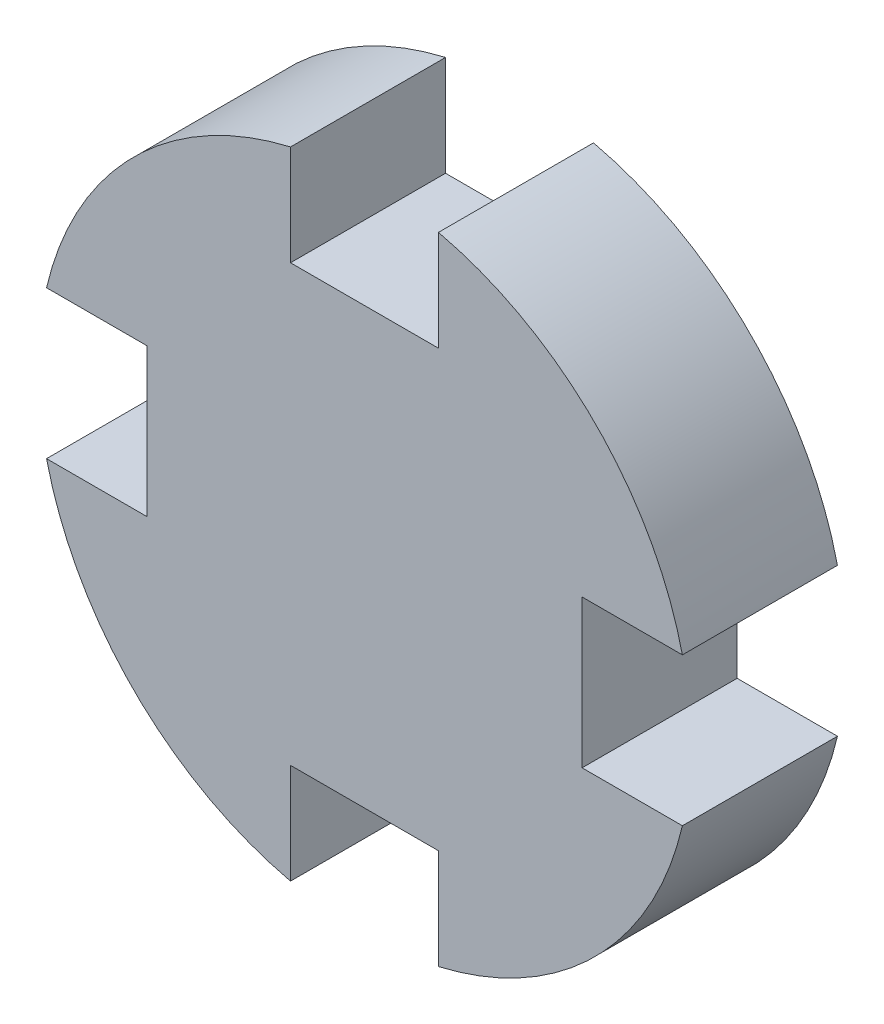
ISO-10303-21;
HEADER;
FILE_DESCRIPTION(('STEP AP214'),'2;1');
FILE_NAME('part.step','',(''),(''),'','','');
FILE_SCHEMA(('AUTOMOTIVE_DESIGN { 1 0 10303 214 1 1 1 1 }'));
ENDSEC;
DATA;
#1=APPLICATION_CONTEXT('core data for automotive mechanical design processes');
#2=APPLICATION_PROTOCOL_DEFINITION('international standard','automotive_design',2000,#1);
#3=PRODUCT_CONTEXT('',#1,'mechanical');
#4=PRODUCT('Part','Part','',(#3));
#5=PRODUCT_RELATED_PRODUCT_CATEGORY('part','',(#4));
#6=PRODUCT_DEFINITION_FORMATION('','',#4);
#7=PRODUCT_DEFINITION_CONTEXT('part definition',#1,'design');
#8=PRODUCT_DEFINITION('design','',#6,#7);
#9=PRODUCT_DEFINITION_SHAPE('','',#8);
#10=(LENGTH_UNIT() NAMED_UNIT(*) SI_UNIT(.MILLI.,.METRE.));
#11=(NAMED_UNIT(*) PLANE_ANGLE_UNIT() SI_UNIT($,.RADIAN.));
#12=(NAMED_UNIT(*) SI_UNIT($,.STERADIAN.) SOLID_ANGLE_UNIT());
#13=UNCERTAINTY_MEASURE_WITH_UNIT(LENGTH_MEASURE(1.E-05),#10,'distance_accuracy_value','');
#14=(GEOMETRIC_REPRESENTATION_CONTEXT(3) GLOBAL_UNCERTAINTY_ASSIGNED_CONTEXT((#13)) GLOBAL_UNIT_ASSIGNED_CONTEXT((#10,
#11,#12)) REPRESENTATION_CONTEXT('',''));
#15=CARTESIAN_POINT('',(0.,0.,0.));
#16=DIRECTION('',(0.,0.,1.));
#17=DIRECTION('',(1.,0.,0.));
#18=AXIS2_PLACEMENT_3D('',#15,#16,#17);
#19=CARTESIAN_POINT('',(0.,0.,5.7));
#20=DIRECTION('',(0.,0.,-1.));
#21=DIRECTION('',(-1.,0.,0.));
#22=AXIS2_PLACEMENT_3D('',#19,#20,#21);
#23=CYLINDRICAL_SURFACE('',#22,12.);
#24=CARTESIAN_POINT('',(0.,0.,5.7));
#25=DIRECTION('',(0.,0.,1.));
#26=DIRECTION('',(1.,0.,0.));
#27=AXIS2_PLACEMENT_3D('',#24,#25,#26);
#28=CIRCLE('',#27,12.);
#29=CARTESIAN_POINT('',(-11.6876687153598,-2.72,5.7));
#30=VERTEX_POINT('',#29);
#31=CARTESIAN_POINT('',(-2.72000000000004,-11.6876687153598,5.7));
#32=VERTEX_POINT('',#31);
#33=EDGE_CURVE('E237',#30,#32,#28,.T.);
#34=ORIENTED_EDGE('',*,*,#33,.F.);
#35=DIRECTION('',(0.,0.,-1.));
#36=VECTOR('',#35,1.);
#37=CARTESIAN_POINT('',(-11.6876687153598,-2.72,5.7));
#38=LINE('',#37,#36);
#39=CARTESIAN_POINT('',(-11.6876687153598,-2.72,0.));
#40=VERTEX_POINT('',#39);
#41=EDGE_CURVE('E191',#30,#40,#38,.T.);
#42=ORIENTED_EDGE('',*,*,#41,.T.);
#43=CARTESIAN_POINT('',(0.,0.,0.));
#44=DIRECTION('',(0.,0.,1.));
#45=DIRECTION('',(1.,0.,0.));
#46=AXIS2_PLACEMENT_3D('',#43,#44,#45);
#47=CIRCLE('',#46,12.);
#48=CARTESIAN_POINT('',(-2.72000000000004,-11.6876687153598,0.));
#49=VERTEX_POINT('',#48);
#50=EDGE_CURVE('E243',#40,#49,#47,.T.);
#51=ORIENTED_EDGE('',*,*,#50,.T.);
#52=DIRECTION('',(0.,0.,-1.));
#53=VECTOR('',#52,1.);
#54=CARTESIAN_POINT('',(-2.72000000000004,-11.6876687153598,5.7));
#55=LINE('',#54,#53);
#56=EDGE_CURVE('E206',#49,#32,#55,.F.);
#57=ORIENTED_EDGE('',*,*,#56,.T.);
#58=EDGE_LOOP('',(#34,#42,#51,#57));
#59=FACE_BOUND('',#58,.T.);
#60=ADVANCED_FACE('F35',(#59),#23,.T.);
#61=CARTESIAN_POINT('',(-2.71999999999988,11.6876687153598,0.));
#62=VERTEX_POINT('',#61);
#63=CARTESIAN_POINT('',(-11.6876687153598,2.72,0.));
#64=VERTEX_POINT('',#63);
#65=EDGE_CURVE('E242',#62,#64,#47,.T.);
#66=ORIENTED_EDGE('',*,*,#65,.T.);
#67=DIRECTION('',(0.,0.,-1.));
#68=VECTOR('',#67,1.);
#69=CARTESIAN_POINT('',(-11.6876687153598,2.72,5.7));
#70=LINE('',#69,#68);
#71=CARTESIAN_POINT('',(-11.6876687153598,2.72,5.7));
#72=VERTEX_POINT('',#71);
#73=EDGE_CURVE('E50',#64,#72,#70,.F.);
#74=ORIENTED_EDGE('',*,*,#73,.T.);
#75=CARTESIAN_POINT('',(-2.71999999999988,11.6876687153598,5.7));
#76=VERTEX_POINT('',#75);
#77=EDGE_CURVE('E170',#76,#72,#28,.T.);
#78=ORIENTED_EDGE('',*,*,#77,.F.);
#79=DIRECTION('',(0.,0.,-1.));
#80=VECTOR('',#79,1.);
#81=CARTESIAN_POINT('',(-2.71999999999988,11.6876687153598,5.7));
#82=LINE('',#81,#80);
#83=EDGE_CURVE('E187',#76,#62,#82,.T.);
#84=ORIENTED_EDGE('',*,*,#83,.T.);
#85=EDGE_LOOP('',(#66,#74,#78,#84));
#86=FACE_BOUND('',#85,.T.);
#87=ADVANCED_FACE('F293',(#86),#23,.T.);
#88=CARTESIAN_POINT('',(2.71999999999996,-11.6876687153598,5.7));
#89=VERTEX_POINT('',#88);
#90=CARTESIAN_POINT('',(11.6876687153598,-2.72,5.7));
#91=VERTEX_POINT('',#90);
#92=EDGE_CURVE('E238',#89,#91,#28,.T.);
#93=ORIENTED_EDGE('',*,*,#92,.F.);
#94=DIRECTION('',(0.,0.,-1.));
#95=VECTOR('',#94,1.);
#96=CARTESIAN_POINT('',(2.71999999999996,-11.6876687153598,5.7));
#97=LINE('',#96,#95);
#98=CARTESIAN_POINT('',(2.71999999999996,-11.6876687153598,0.));
#99=VERTEX_POINT('',#98);
#100=EDGE_CURVE('E210',#89,#99,#97,.T.);
#101=ORIENTED_EDGE('',*,*,#100,.T.);
#102=CARTESIAN_POINT('',(11.6876687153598,-2.72,0.));
#103=VERTEX_POINT('',#102);
#104=EDGE_CURVE('E232',#99,#103,#47,.T.);
#105=ORIENTED_EDGE('',*,*,#104,.T.);
#106=DIRECTION('',(0.,0.,-1.));
#107=VECTOR('',#106,1.);
#108=CARTESIAN_POINT('',(11.6876687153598,-2.72,5.7));
#109=LINE('',#108,#107);
#110=EDGE_CURVE('E225',#103,#91,#109,.F.);
#111=ORIENTED_EDGE('',*,*,#110,.T.);
#112=EDGE_LOOP('',(#93,#101,#105,#111));
#113=FACE_BOUND('',#112,.T.);
#114=ADVANCED_FACE('F290',(#113),#23,.T.);
#115=CARTESIAN_POINT('',(11.6876687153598,2.72,0.));
#116=VERTEX_POINT('',#115);
#117=CARTESIAN_POINT('',(2.72000000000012,11.6876687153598,0.));
#118=VERTEX_POINT('',#117);
#119=EDGE_CURVE('E239',#116,#118,#47,.T.);
#120=ORIENTED_EDGE('',*,*,#119,.T.);
#121=DIRECTION('',(0.,0.,-1.));
#122=VECTOR('',#121,1.);
#123=CARTESIAN_POINT('',(2.72000000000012,11.6876687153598,5.7));
#124=LINE('',#123,#122);
#125=CARTESIAN_POINT('',(2.72000000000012,11.6876687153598,5.7));
#126=VERTEX_POINT('',#125);
#127=EDGE_CURVE('E58',#118,#126,#124,.F.);
#128=ORIENTED_EDGE('',*,*,#127,.T.);
#129=CARTESIAN_POINT('',(11.6876687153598,2.72,5.7));
#130=VERTEX_POINT('',#129);
#131=EDGE_CURVE('E233',#130,#126,#28,.T.);
#132=ORIENTED_EDGE('',*,*,#131,.F.);
#133=DIRECTION('',(0.,0.,-1.));
#134=VECTOR('',#133,1.);
#135=CARTESIAN_POINT('',(11.6876687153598,2.72,5.7));
#136=LINE('',#135,#134);
#137=EDGE_CURVE('E229',#130,#116,#136,.T.);
#138=ORIENTED_EDGE('',*,*,#137,.T.);
#139=EDGE_LOOP('',(#120,#128,#132,#138));
#140=FACE_BOUND('',#139,.T.);
#141=ADVANCED_FACE('F37',(#140),#23,.T.);
#142=CARTESIAN_POINT('',(0.,0.,5.7));
#143=DIRECTION('',(0.,0.,1.));
#144=DIRECTION('',(1.,0.,0.));
#145=AXIS2_PLACEMENT_3D('',#142,#143,#144);
#146=PLANE('',#145);
#147=DIRECTION('',(1.,0.,0.));
#148=VECTOR('',#147,1.);
#149=CARTESIAN_POINT('',(-12.,-2.72,5.7));
#150=LINE('',#149,#148);
#151=CARTESIAN_POINT('',(-8.,-2.72,5.7));
#152=VERTEX_POINT('',#151);
#153=EDGE_CURVE('E155',#30,#152,#150,.T.);
#154=ORIENTED_EDGE('',*,*,#153,.F.);
#155=ORIENTED_EDGE('',*,*,#33,.T.);
#156=DIRECTION('',(0.,-1.,0.));
#157=VECTOR('',#156,1.);
#158=CARTESIAN_POINT('',(-2.72000000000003,-7.99999999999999,5.7));
#159=LINE('',#158,#157);
#160=CARTESIAN_POINT('',(-2.72000000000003,-7.99999999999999,5.7));
#161=VERTEX_POINT('',#160);
#162=EDGE_CURVE('E197',#161,#32,#159,.T.);
#163=ORIENTED_EDGE('',*,*,#162,.F.);
#164=DIRECTION('',(-1.,0.,0.));
#165=VECTOR('',#164,1.);
#166=CARTESIAN_POINT('',(2.71999999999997,-8.00000000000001,5.7));
#167=LINE('',#166,#165);
#168=CARTESIAN_POINT('',(2.71999999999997,-8.00000000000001,5.7));
#169=VERTEX_POINT('',#168);
#170=EDGE_CURVE('E194',#169,#161,#167,.T.);
#171=ORIENTED_EDGE('',*,*,#170,.F.);
#172=DIRECTION('',(0.,1.,0.));
#173=VECTOR('',#172,1.);
#174=CARTESIAN_POINT('',(2.71999999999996,-12.,5.7));
#175=LINE('',#174,#173);
#176=EDGE_CURVE('E200',#89,#169,#175,.T.);
#177=ORIENTED_EDGE('',*,*,#176,.F.);
#178=ORIENTED_EDGE('',*,*,#92,.T.);
#179=DIRECTION('',(1.,0.,0.));
#180=VECTOR('',#179,1.);
#181=CARTESIAN_POINT('',(8.,-2.72,5.7));
#182=LINE('',#181,#180);
#183=CARTESIAN_POINT('',(8.,-2.72,5.7));
#184=VERTEX_POINT('',#183);
#185=EDGE_CURVE('E216',#184,#91,#182,.T.);
#186=ORIENTED_EDGE('',*,*,#185,.F.);
#187=DIRECTION('',(0.,-1.,0.));
#188=VECTOR('',#187,1.);
#189=CARTESIAN_POINT('',(8.,2.72,5.7));
#190=LINE('',#189,#188);
#191=CARTESIAN_POINT('',(8.,2.72,5.7));
#192=VERTEX_POINT('',#191);
#193=EDGE_CURVE('E213',#192,#184,#190,.T.);
#194=ORIENTED_EDGE('',*,*,#193,.F.);
#195=DIRECTION('',(-1.,0.,0.));
#196=VECTOR('',#195,1.);
#197=CARTESIAN_POINT('',(12.,2.72,5.7));
#198=LINE('',#197,#196);
#199=EDGE_CURVE('E219',#130,#192,#198,.T.);
#200=ORIENTED_EDGE('',*,*,#199,.F.);
#201=ORIENTED_EDGE('',*,*,#131,.T.);
#202=DIRECTION('',(0.,1.,0.));
#203=VECTOR('',#202,1.);
#204=CARTESIAN_POINT('',(2.72000000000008,7.99999999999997,5.7));
#205=LINE('',#204,#203);
#206=CARTESIAN_POINT('',(2.72000000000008,7.99999999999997,5.7));
#207=VERTEX_POINT('',#206);
#208=EDGE_CURVE('E178',#207,#126,#205,.T.);
#209=ORIENTED_EDGE('',*,*,#208,.F.);
#210=DIRECTION('',(1.,0.,0.));
#211=VECTOR('',#210,1.);
#212=CARTESIAN_POINT('',(-2.71999999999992,8.00000000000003,5.7));
#213=LINE('',#212,#211);
#214=CARTESIAN_POINT('',(-2.71999999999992,8.00000000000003,5.7));
#215=VERTEX_POINT('',#214);
#216=EDGE_CURVE('E175',#215,#207,#213,.T.);
#217=ORIENTED_EDGE('',*,*,#216,.F.);
#218=DIRECTION('',(0.,-1.,0.));
#219=VECTOR('',#218,1.);
#220=CARTESIAN_POINT('',(-2.71999999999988,12.,5.7));
#221=LINE('',#220,#219);
#222=EDGE_CURVE('E180',#76,#215,#221,.T.);
#223=ORIENTED_EDGE('',*,*,#222,.F.);
#224=ORIENTED_EDGE('',*,*,#77,.T.);
#225=DIRECTION('',(-1.,0.,0.));
#226=VECTOR('',#225,1.);
#227=CARTESIAN_POINT('',(-8.,2.72,5.7));
#228=LINE('',#227,#226);
#229=CARTESIAN_POINT('',(-8.,2.72,5.7));
#230=VERTEX_POINT('',#229);
#231=EDGE_CURVE('E150',#230,#72,#228,.T.);
#232=ORIENTED_EDGE('',*,*,#231,.F.);
#233=DIRECTION('',(0.,1.,0.));
#234=VECTOR('',#233,1.);
#235=CARTESIAN_POINT('',(-8.,-2.72,5.7));
#236=LINE('',#235,#234);
#237=EDGE_CURVE('E158',#152,#230,#236,.T.);
#238=ORIENTED_EDGE('',*,*,#237,.F.);
#239=EDGE_LOOP('',(#154,#155,#163,#171,#177,#178,#186,#194,#200,#201,#209,#217,#223,#224,#232,#238));
#240=FACE_BOUND('',#239,.T.);
#241=ADVANCED_FACE('F167',(#240),#146,.T.);
#242=CARTESIAN_POINT('',(0.,0.,0.));
#243=DIRECTION('',(0.,0.,1.));
#244=DIRECTION('',(1.,0.,0.));
#245=AXIS2_PLACEMENT_3D('',#242,#243,#244);
#246=PLANE('',#245);
#247=ORIENTED_EDGE('',*,*,#50,.F.);
#248=DIRECTION('',(1.,0.,0.));
#249=VECTOR('',#248,1.);
#250=CARTESIAN_POINT('',(0.,-2.72,0.));
#251=LINE('',#250,#249);
#252=CARTESIAN_POINT('',(-8.,-2.72,0.));
#253=VERTEX_POINT('',#252);
#254=EDGE_CURVE('E11',#40,#253,#251,.T.);
#255=ORIENTED_EDGE('',*,*,#254,.T.);
#256=DIRECTION('',(0.,1.,0.));
#257=VECTOR('',#256,1.);
#258=CARTESIAN_POINT('',(-8.,0.,0.));
#259=LINE('',#258,#257);
#260=CARTESIAN_POINT('',(-8.,2.72,0.));
#261=VERTEX_POINT('',#260);
#262=EDGE_CURVE('E43',#253,#261,#259,.T.);
#263=ORIENTED_EDGE('',*,*,#262,.T.);
#264=DIRECTION('',(-1.,0.,0.));
#265=VECTOR('',#264,1.);
#266=CARTESIAN_POINT('',(0.,2.72,0.));
#267=LINE('',#266,#265);
#268=EDGE_CURVE('E151',#261,#64,#267,.T.);
#269=ORIENTED_EDGE('',*,*,#268,.T.);
#270=ORIENTED_EDGE('',*,*,#65,.F.);
#271=DIRECTION('',(0.,-1.,0.));
#272=VECTOR('',#271,1.);
#273=CARTESIAN_POINT('',(-2.72,0.,0.));
#274=LINE('',#273,#272);
#275=CARTESIAN_POINT('',(-2.71999999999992,8.00000000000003,0.));
#276=VERTEX_POINT('',#275);
#277=EDGE_CURVE('E266',#62,#276,#274,.T.);
#278=ORIENTED_EDGE('',*,*,#277,.T.);
#279=DIRECTION('',(1.,0.,0.));
#280=VECTOR('',#279,1.);
#281=CARTESIAN_POINT('',(0.,8.,0.));
#282=LINE('',#281,#280);
#283=CARTESIAN_POINT('',(2.72000000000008,7.99999999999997,0.));
#284=VERTEX_POINT('',#283);
#285=EDGE_CURVE('E263',#276,#284,#282,.T.);
#286=ORIENTED_EDGE('',*,*,#285,.T.);
#287=DIRECTION('',(0.,1.,0.));
#288=VECTOR('',#287,1.);
#289=CARTESIAN_POINT('',(2.72,0.,0.));
#290=LINE('',#289,#288);
#291=EDGE_CURVE('E261',#284,#118,#290,.T.);
#292=ORIENTED_EDGE('',*,*,#291,.T.);
#293=ORIENTED_EDGE('',*,*,#119,.F.);
#294=DIRECTION('',(-1.,0.,0.));
#295=VECTOR('',#294,1.);
#296=CARTESIAN_POINT('',(0.,2.72,0.));
#297=LINE('',#296,#295);
#298=CARTESIAN_POINT('',(8.,2.72,0.));
#299=VERTEX_POINT('',#298);
#300=EDGE_CURVE('E249',#116,#299,#297,.T.);
#301=ORIENTED_EDGE('',*,*,#300,.T.);
#302=DIRECTION('',(0.,-1.,0.));
#303=VECTOR('',#302,1.);
#304=CARTESIAN_POINT('',(8.,0.,0.));
#305=LINE('',#304,#303);
#306=CARTESIAN_POINT('',(8.,-2.72,0.));
#307=VERTEX_POINT('',#306);
#308=EDGE_CURVE('E246',#299,#307,#305,.T.);
#309=ORIENTED_EDGE('',*,*,#308,.T.);
#310=DIRECTION('',(1.,0.,0.));
#311=VECTOR('',#310,1.);
#312=CARTESIAN_POINT('',(0.,-2.72,0.));
#313=LINE('',#312,#311);
#314=EDGE_CURVE('E236',#307,#103,#313,.T.);
#315=ORIENTED_EDGE('',*,*,#314,.T.);
#316=ORIENTED_EDGE('',*,*,#104,.F.);
#317=DIRECTION('',(0.,1.,0.));
#318=VECTOR('',#317,1.);
#319=CARTESIAN_POINT('',(2.72,0.,0.));
#320=LINE('',#319,#318);
#321=CARTESIAN_POINT('',(2.71999999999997,-8.00000000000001,0.));
#322=VERTEX_POINT('',#321);
#323=EDGE_CURVE('E258',#99,#322,#320,.T.);
#324=ORIENTED_EDGE('',*,*,#323,.T.);
#325=DIRECTION('',(-1.,0.,0.));
#326=VECTOR('',#325,1.);
#327=CARTESIAN_POINT('',(0.,-8.,0.));
#328=LINE('',#327,#326);
#329=CARTESIAN_POINT('',(-2.72000000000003,-7.99999999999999,0.));
#330=VERTEX_POINT('',#329);
#331=EDGE_CURVE('E255',#322,#330,#328,.T.);
#332=ORIENTED_EDGE('',*,*,#331,.T.);
#333=DIRECTION('',(0.,-1.,0.));
#334=VECTOR('',#333,1.);
#335=CARTESIAN_POINT('',(-2.72,0.,0.));
#336=LINE('',#335,#334);
#337=EDGE_CURVE('E252',#330,#49,#336,.T.);
#338=ORIENTED_EDGE('',*,*,#337,.T.);
#339=EDGE_LOOP('',(#247,#255,#263,#269,#270,#278,#286,#292,#293,#301,#309,#315,#316,#324,#332,#338));
#340=FACE_BOUND('',#339,.T.);
#341=ADVANCED_FACE('F271',(#340),#246,.F.);
#342=CARTESIAN_POINT('',(8.,2.72,-4.3));
#343=DIRECTION('',(-1.,0.,0.));
#344=DIRECTION('',(0.,0.,1.));
#345=AXIS2_PLACEMENT_3D('',#342,#343,#344);
#346=PLANE('',#345);
#347=DIRECTION('',(0.,0.,1.));
#348=VECTOR('',#347,1.);
#349=CARTESIAN_POINT('',(8.,2.72,-4.3));
#350=LINE('',#349,#348);
#351=EDGE_CURVE('E223',#299,#192,#350,.T.);
#352=ORIENTED_EDGE('',*,*,#351,.T.);
#353=ORIENTED_EDGE('',*,*,#193,.T.);
#354=DIRECTION('',(0.,0.,1.));
#355=VECTOR('',#354,1.);
#356=CARTESIAN_POINT('',(8.,-2.72,-4.3));
#357=LINE('',#356,#355);
#358=EDGE_CURVE('E222',#307,#184,#357,.T.);
#359=ORIENTED_EDGE('',*,*,#358,.F.);
#360=ORIENTED_EDGE('',*,*,#308,.F.);
#361=EDGE_LOOP('',(#352,#353,#359,#360));
#362=FACE_BOUND('',#361,.T.);
#363=ADVANCED_FACE('F311',(#362),#346,.F.);
#364=CARTESIAN_POINT('',(12.,2.72,-4.3));
#365=DIRECTION('',(0.,1.,0.));
#366=DIRECTION('',(-1.,0.,0.));
#367=AXIS2_PLACEMENT_3D('',#364,#365,#366);
#368=PLANE('',#367);
#369=ORIENTED_EDGE('',*,*,#199,.T.);
#370=ORIENTED_EDGE('',*,*,#351,.F.);
#371=ORIENTED_EDGE('',*,*,#300,.F.);
#372=ORIENTED_EDGE('',*,*,#137,.F.);
#373=EDGE_LOOP('',(#369,#370,#371,#372));
#374=FACE_BOUND('',#373,.T.);
#375=ADVANCED_FACE('F308',(#374),#368,.F.);
#376=CARTESIAN_POINT('',(8.,-2.72,-4.3));
#377=DIRECTION('',(0.,-1.,0.));
#378=DIRECTION('',(1.,0.,0.));
#379=AXIS2_PLACEMENT_3D('',#376,#377,#378);
#380=PLANE('',#379);
#381=ORIENTED_EDGE('',*,*,#314,.F.);
#382=ORIENTED_EDGE('',*,*,#358,.T.);
#383=ORIENTED_EDGE('',*,*,#185,.T.);
#384=ORIENTED_EDGE('',*,*,#110,.F.);
#385=EDGE_LOOP('',(#381,#382,#383,#384));
#386=FACE_BOUND('',#385,.T.);
#387=ADVANCED_FACE('F288',(#386),#380,.F.);
#388=CARTESIAN_POINT('',(2.71999999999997,-8.00000000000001,-4.3));
#389=DIRECTION('',(0.,1.,0.));
#390=DIRECTION('',(-1.,0.,0.));
#391=AXIS2_PLACEMENT_3D('',#388,#389,#390);
#392=PLANE('',#391);
#393=DIRECTION('',(0.,0.,1.));
#394=VECTOR('',#393,1.);
#395=CARTESIAN_POINT('',(2.71999999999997,-8.00000000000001,-4.3));
#396=LINE('',#395,#394);
#397=EDGE_CURVE('E204',#322,#169,#396,.T.);
#398=ORIENTED_EDGE('',*,*,#397,.T.);
#399=ORIENTED_EDGE('',*,*,#170,.T.);
#400=DIRECTION('',(0.,0.,1.));
#401=VECTOR('',#400,1.);
#402=CARTESIAN_POINT('',(-2.72000000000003,-7.99999999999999,-4.3));
#403=LINE('',#402,#401);
#404=EDGE_CURVE('E203',#330,#161,#403,.T.);
#405=ORIENTED_EDGE('',*,*,#404,.F.);
#406=ORIENTED_EDGE('',*,*,#331,.F.);
#407=EDGE_LOOP('',(#398,#399,#405,#406));
#408=FACE_BOUND('',#407,.T.);
#409=ADVANCED_FACE('F350',(#408),#392,.F.);
#410=CARTESIAN_POINT('',(2.71999999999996,-12.,-4.3));
#411=DIRECTION('',(1.,0.,0.));
#412=DIRECTION('',(0.,1.,0.));
#413=AXIS2_PLACEMENT_3D('',#410,#411,#412);
#414=PLANE('',#413);
#415=ORIENTED_EDGE('',*,*,#176,.T.);
#416=ORIENTED_EDGE('',*,*,#397,.F.);
#417=ORIENTED_EDGE('',*,*,#323,.F.);
#418=ORIENTED_EDGE('',*,*,#100,.F.);
#419=EDGE_LOOP('',(#415,#416,#417,#418));
#420=FACE_BOUND('',#419,.T.);
#421=ADVANCED_FACE('F383',(#420),#414,.F.);
#422=CARTESIAN_POINT('',(-2.72000000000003,-7.99999999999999,-4.3));
#423=DIRECTION('',(-1.,0.,0.));
#424=DIRECTION('',(0.,-1.,0.));
#425=AXIS2_PLACEMENT_3D('',#422,#423,#424);
#426=PLANE('',#425);
#427=ORIENTED_EDGE('',*,*,#337,.F.);
#428=ORIENTED_EDGE('',*,*,#404,.T.);
#429=ORIENTED_EDGE('',*,*,#162,.T.);
#430=ORIENTED_EDGE('',*,*,#56,.F.);
#431=EDGE_LOOP('',(#427,#428,#429,#430));
#432=FACE_BOUND('',#431,.T.);
#433=ADVANCED_FACE('F393',(#432),#426,.F.);
#434=CARTESIAN_POINT('',(-2.71999999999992,8.00000000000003,-4.3));
#435=DIRECTION('',(0.,-1.,0.));
#436=DIRECTION('',(1.,0.,0.));
#437=AXIS2_PLACEMENT_3D('',#434,#435,#436);
#438=PLANE('',#437);
#439=DIRECTION('',(0.,0.,1.));
#440=VECTOR('',#439,1.);
#441=CARTESIAN_POINT('',(-2.71999999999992,8.00000000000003,-4.3));
#442=LINE('',#441,#440);
#443=EDGE_CURVE('E164',#276,#215,#442,.T.);
#444=ORIENTED_EDGE('',*,*,#443,.T.);
#445=ORIENTED_EDGE('',*,*,#216,.T.);
#446=DIRECTION('',(0.,0.,1.));
#447=VECTOR('',#446,1.);
#448=CARTESIAN_POINT('',(2.72000000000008,7.99999999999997,-4.3));
#449=LINE('',#448,#447);
#450=EDGE_CURVE('E183',#284,#207,#449,.T.);
#451=ORIENTED_EDGE('',*,*,#450,.F.);
#452=ORIENTED_EDGE('',*,*,#285,.F.);
#453=EDGE_LOOP('',(#444,#445,#451,#452));
#454=FACE_BOUND('',#453,.T.);
#455=ADVANCED_FACE('F299',(#454),#438,.F.);
#456=CARTESIAN_POINT('',(-2.71999999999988,12.,-4.3));
#457=DIRECTION('',(-1.,0.,0.));
#458=DIRECTION('',(0.,-1.,0.));
#459=AXIS2_PLACEMENT_3D('',#456,#457,#458);
#460=PLANE('',#459);
#461=ORIENTED_EDGE('',*,*,#222,.T.);
#462=ORIENTED_EDGE('',*,*,#443,.F.);
#463=ORIENTED_EDGE('',*,*,#277,.F.);
#464=ORIENTED_EDGE('',*,*,#83,.F.);
#465=EDGE_LOOP('',(#461,#462,#463,#464));
#466=FACE_BOUND('',#465,.T.);
#467=ADVANCED_FACE('F296',(#466),#460,.F.);
#468=CARTESIAN_POINT('',(2.72000000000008,7.99999999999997,-4.3));
#469=DIRECTION('',(1.,0.,0.));
#470=DIRECTION('',(0.,1.,0.));
#471=AXIS2_PLACEMENT_3D('',#468,#469,#470);
#472=PLANE('',#471);
#473=ORIENTED_EDGE('',*,*,#291,.F.);
#474=ORIENTED_EDGE('',*,*,#450,.T.);
#475=ORIENTED_EDGE('',*,*,#208,.T.);
#476=ORIENTED_EDGE('',*,*,#127,.F.);
#477=EDGE_LOOP('',(#473,#474,#475,#476));
#478=FACE_BOUND('',#477,.T.);
#479=ADVANCED_FACE('F302',(#478),#472,.F.);
#480=CARTESIAN_POINT('',(-8.,-2.72,-4.3));
#481=DIRECTION('',(1.,0.,0.));
#482=DIRECTION('',(0.,0.,-1.));
#483=AXIS2_PLACEMENT_3D('',#480,#481,#482);
#484=PLANE('',#483);
#485=DIRECTION('',(0.,0.,1.));
#486=VECTOR('',#485,1.);
#487=CARTESIAN_POINT('',(-8.,-2.72,-4.3));
#488=LINE('',#487,#486);
#489=EDGE_CURVE('E154',#253,#152,#488,.T.);
#490=ORIENTED_EDGE('',*,*,#489,.T.);
#491=ORIENTED_EDGE('',*,*,#237,.T.);
#492=DIRECTION('',(0.,0.,1.));
#493=VECTOR('',#492,1.);
#494=CARTESIAN_POINT('',(-8.,2.72,-4.3));
#495=LINE('',#494,#493);
#496=EDGE_CURVE('E146',#261,#230,#495,.T.);
#497=ORIENTED_EDGE('',*,*,#496,.F.);
#498=ORIENTED_EDGE('',*,*,#262,.F.);
#499=EDGE_LOOP('',(#490,#491,#497,#498));
#500=FACE_BOUND('',#499,.T.);
#501=ADVANCED_FACE('F159',(#500),#484,.F.);
#502=CARTESIAN_POINT('',(-12.,-2.72,-4.3));
#503=DIRECTION('',(0.,-1.,0.));
#504=DIRECTION('',(1.,0.,0.));
#505=AXIS2_PLACEMENT_3D('',#502,#503,#504);
#506=PLANE('',#505);
#507=ORIENTED_EDGE('',*,*,#153,.T.);
#508=ORIENTED_EDGE('',*,*,#489,.F.);
#509=ORIENTED_EDGE('',*,*,#254,.F.);
#510=ORIENTED_EDGE('',*,*,#41,.F.);
#511=EDGE_LOOP('',(#507,#508,#509,#510));
#512=FACE_BOUND('',#511,.T.);
#513=ADVANCED_FACE('F275',(#512),#506,.F.);
#514=CARTESIAN_POINT('',(-8.,2.72,-4.3));
#515=DIRECTION('',(0.,1.,0.));
#516=DIRECTION('',(-1.,0.,0.));
#517=AXIS2_PLACEMENT_3D('',#514,#515,#516);
#518=PLANE('',#517);
#519=ORIENTED_EDGE('',*,*,#268,.F.);
#520=ORIENTED_EDGE('',*,*,#496,.T.);
#521=ORIENTED_EDGE('',*,*,#231,.T.);
#522=ORIENTED_EDGE('',*,*,#73,.F.);
#523=EDGE_LOOP('',(#519,#520,#521,#522));
#524=FACE_BOUND('',#523,.T.);
#525=ADVANCED_FACE('F148',(#524),#518,.F.);
#526=CLOSED_SHELL('',(#60,#87,#114,#141,#241,#341,#363,#375,#387,#409,#421,#433,#455,#467,#479,
#501,#513,#525));
#527=MANIFOLD_SOLID_BREP('B2',#526);
#528=ADVANCED_BREP_SHAPE_REPRESENTATION('',(#18,#527),#14);
#529=SHAPE_DEFINITION_REPRESENTATION(#9,#528);
ENDSEC;
END-ISO-10303-21;
